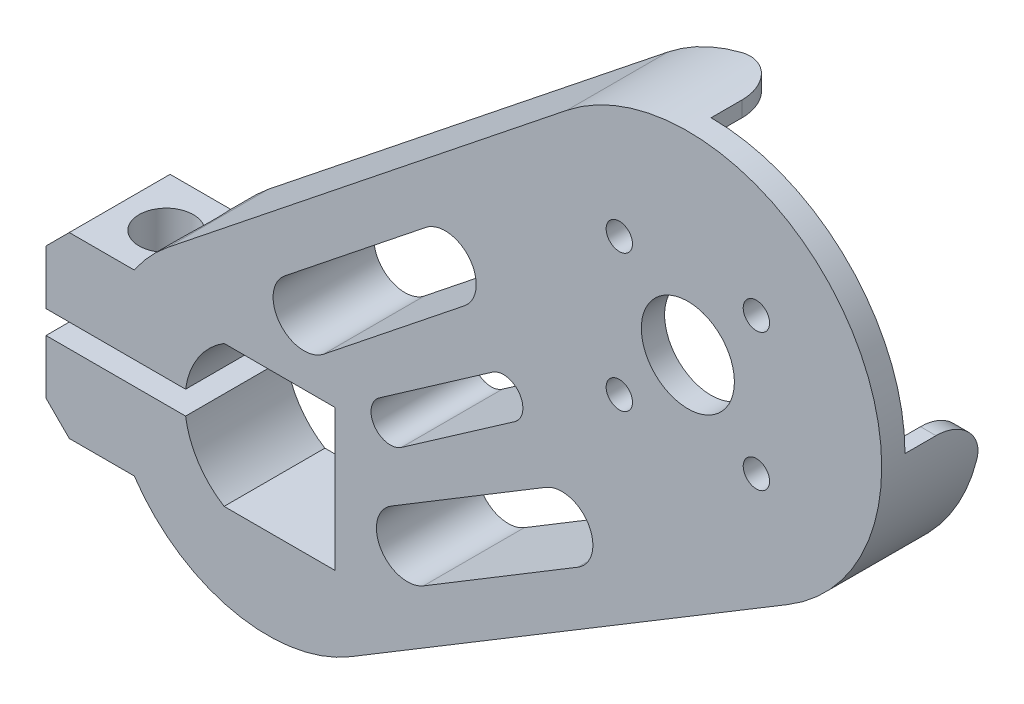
from build123d import *

# Parameters (mm, degrees)
ESQUISSE1_R             = 1.7
ESQUISSE1_R_2           = 6
BOSS_EXTRU_1_DEPTH      = 3
BOSS_EXTRU_6_START      = 10
BOSS_EXTRU_6_DEPTH      = 10
ENL_V_MAT_EXTRU_1_DEPTH = 96.841122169
BOSS_EXTRU_7_START      = -13
BOSS_EXTRU_7_DEPTH      = 13
ESQUISSE7_R             = 6
ENL_V_MAT_EXTRU_2_DEPTH = 10
ESQUISSE9_R             = 3.5
ENL_V_MAT_EXTRU_3_DEPTH = 112.606748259
ESQUISSE10_R            = 6
ENL_V_MAT_EXTRU_4_DEPTH = 98.835914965
CHANFREIN1_SIZE         = 3
ENL_V_MAT_EXTRU_5_DEPTH = 103.12730423
CONG_1_R                = 6


with BuildPart() as part:
    # Esquisse1 → Boss.-Extru.1 (new body)
    with BuildSketch(Plane.XY):
        with BuildLine():
            Line((-67.078897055, -21.515844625), (-15.586875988, 19.54608137))
            ThreePointArc((-15.586875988, 19.54608137), (20.520062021, 14.28030303), (12.913049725, -21.406848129))
            Line((12.913049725, -21.406848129), (-43.480958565, -55.424870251))
            ThreePointArc((-43.480958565, -55.424870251), (-71.16357509, -49.524090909), (-67.078897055, -21.515844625))
        make_face()
        with Locations((-8.838834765, 8.838834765)):
            Circle(ESQUISSE1_R, mode=Mode.SUBTRACT)
        with Locations((8.838834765, 8.838834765)):
            Circle(ESQUISSE1_R, mode=Mode.SUBTRACT)
        with Locations((8.838834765, -8.838834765)):
            Circle(ESQUISSE1_R, mode=Mode.SUBTRACT)
        with Locations((-8.838834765, -8.838834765)):
            Circle(ESQUISSE1_R, mode=Mode.SUBTRACT)
        Circle(ESQUISSE1_R_2, mode=Mode.SUBTRACT)
        with BuildLine():
            Line((-59.801462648, -46.8), (-45.472963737, -46.8))
            Line((-45.472963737, -46.8), (-45.472963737, -28.6))
            Line((-45.472963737, -28.6), (-59.801462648, -28.6))
            ThreePointArc((-59.801462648, -28.6), (-64.872963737, -37.7), (-59.801462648, -46.8))
        make_face(mode=Mode.SUBTRACT)
    extrude(amount=BOSS_EXTRU_1_DEPTH)

    # Esquisse2 → Boss.-Extru.6 (add)
    with BuildSketch(Plane(origin=(0, 0, 0), x_dir=(-1, 0, 0), z_dir=(0, 0, -1)).offset(BOSS_EXTRU_6_START)):
        with BuildLine():
            Line((-12.913049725, -21.406848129), (43.480958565, -55.424870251))
            ThreePointArc((43.480958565, -55.424870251), (71.16357509, -49.524090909), (67.078897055, -21.515844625))
            Line((67.078897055, -21.515844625), (15.586875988, 19.54608137))
            ThreePointArc((15.586875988, 19.54608137), (8.256753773, 23.597161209), (0, 25))
            Line((0, 25), (0, 23))
            ThreePointArc((0, 23), (16.263455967, -16.263455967), (-23, 0))
            Line((-23, 0), (-25, 0))
            ThreePointArc((-25, 0), (-21.769545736, -12.291740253), (-12.913049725, -21.406848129))
        make_face()
        with BuildLine():
            Line((45.472963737, -46.8), (45.472963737, -28.6))
            Line((45.472963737, -28.6), (59.801462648, -28.6))
            ThreePointArc((59.801462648, -28.6), (64.872963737, -37.7), (59.801462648, -46.8))
            Line((59.801462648, -46.8), (45.472963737, -46.8))
        make_face(mode=Mode.SUBTRACT)
    extrude(amount=-BOSS_EXTRU_6_DEPTH)

    # Esquisse5 → Enl_v. mat.-Extru.1 (cut, through all)
    with BuildSketch(Plane.XY.offset(3)):
        with BuildLine():
            Line((-74.818544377, -36.2), (-64.767301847, -36.2))
            ThreePointArc((-64.767301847, -36.2), (-64.872963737, -37.7), (-64.767301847, -39.2))
            Line((-64.767301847, -39.2), (-74.818544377, -39.2))
            ThreePointArc((-74.818544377, -39.2), (-74.872963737, -37.7), (-74.818544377, -36.2))
        make_face()
    extrude(amount=-ENL_V_MAT_EXTRU_1_DEPTH, mode=Mode.SUBTRACT)

    # Esquisse6 → Boss.-Extru.7 (add)
    with BuildSketch(Plane.XY.offset(3).offset(BOSS_EXTRU_7_START)):
        with BuildLine():
            Line((-74.818544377, -36.2), (-82.767301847, -36.2))
            Line((-82.767301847, -36.2), (-82.767301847, -26.2))
            Line((-82.767301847, -26.2), (-71.384587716, -26.2))
            ThreePointArc((-71.384587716, -26.2), (-73.750807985, -30.977053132), (-74.818544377, -36.2))
        make_face()
        with BuildLine():
            Line((-74.818544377, -39.2), (-82.767301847, -39.2))
            Line((-82.767301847, -39.2), (-82.767301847, -49.2))
            Line((-82.767301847, -49.2), (-71.384587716, -49.2))
            ThreePointArc((-71.384587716, -49.2), (-73.750807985, -44.422946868), (-74.818544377, -39.2))
        make_face()
    extrude(amount=BOSS_EXTRU_7_DEPTH)

    # Esquisse7 → Enl_v. mat.-Extru.2 (cut)
    with BuildSketch(Plane(origin=(0, -49.2, 0), x_dir=(-1, 0, 0), z_dir=(0, -1, 0))):
        with Locations((73.767301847, 3.5)):
            Circle(ESQUISSE7_R)
    extrude(amount=ENL_V_MAT_EXTRU_2_DEPTH, mode=Mode.SUBTRACT)

    # Esquisse9 → Enl_v. mat.-Extru.3 (cut, through all)
    with BuildSketch(Plane.XZ.offset(49.2)):
        with Locations((-73.767301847, -3.5)):
            Circle(ESQUISSE9_R)
    extrude(amount=-ENL_V_MAT_EXTRU_3_DEPTH, mode=Mode.SUBTRACT)

    # Esquisse10 → Enl_v. mat.-Extru.4 (cut, through all)
    with BuildSketch(Plane(origin=(0, -26.2, 0), x_dir=(1, 0, 0), z_dir=(0, 1, 0))):
        with Locations((-73.767301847, 3.5)):
            Circle(ESQUISSE10_R)
    extrude(amount=ENL_V_MAT_EXTRU_4_DEPTH, mode=Mode.SUBTRACT)

    # Chanfrein1
    chanfrein1_edges = [part.edges().sort_by_distance(p)[0] for p in [
        (-82.767301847, -26.2, -3.5),
        (-82.767301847, -49.2, -3.5),
    ]]
    chamfer(chanfrein1_edges, length=CHANFREIN1_SIZE)

    # Esquisse11 → Enl_v. mat.-Extru.5 (cut, through all)
    with BuildSketch(Plane(origin=(0, 0, -10), x_dir=(-1, 0, 0), z_dir=(0, 0, -1))):
        with BuildLine():
            Line((33.784819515, -2.639904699), (51.978079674, -17.147983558))
            ThreePointArc((51.978079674, -17.147983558), (52.611552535, -22.769256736), (46.990279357, -23.402729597))
            Line((46.990279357, -23.402729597), (28.797019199, -8.894650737))
            ThreePointArc((28.797019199, -8.894650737), (28.163546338, -3.27337756), (33.784819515, -2.639904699))
        make_face()
        with BuildLine():
            Line((25.205275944, -14.514605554), (39.786597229, -24.674743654))
            ThreePointArc((39.786597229, -24.674743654), (40.408528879, -28.155146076), (36.928126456, -28.777077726))
            Line((36.928126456, -28.777077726), (22.346805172, -18.616939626))
            ThreePointArc((22.346805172, -18.616939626), (21.724873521, -15.136537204), (25.205275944, -14.514605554))
        make_face()
        with BuildLine():
            Line((14.178370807, -30.778097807), (34.089476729, -42.820810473))
            ThreePointArc((34.089476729, -42.820810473), (39.582253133, -41.468254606), (38.229697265, -35.975478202))
            Line((38.229697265, -35.975478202), (18.318591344, -23.932765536))
            ThreePointArc((18.318591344, -23.932765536), (12.825814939, -25.285321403), (14.178370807, -30.778097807))
        make_face()
    extrude(amount=-ENL_V_MAT_EXTRU_5_DEPTH, mode=Mode.SUBTRACT)

    # Cong_1
    cong_1_edges = [part.edges().sort_by_distance(p)[0] for p in [
        (0, 24, -10),
        (24, 0, -10),
    ]]
    fillet(cong_1_edges, radius=CONG_1_R)


solid = part.part
